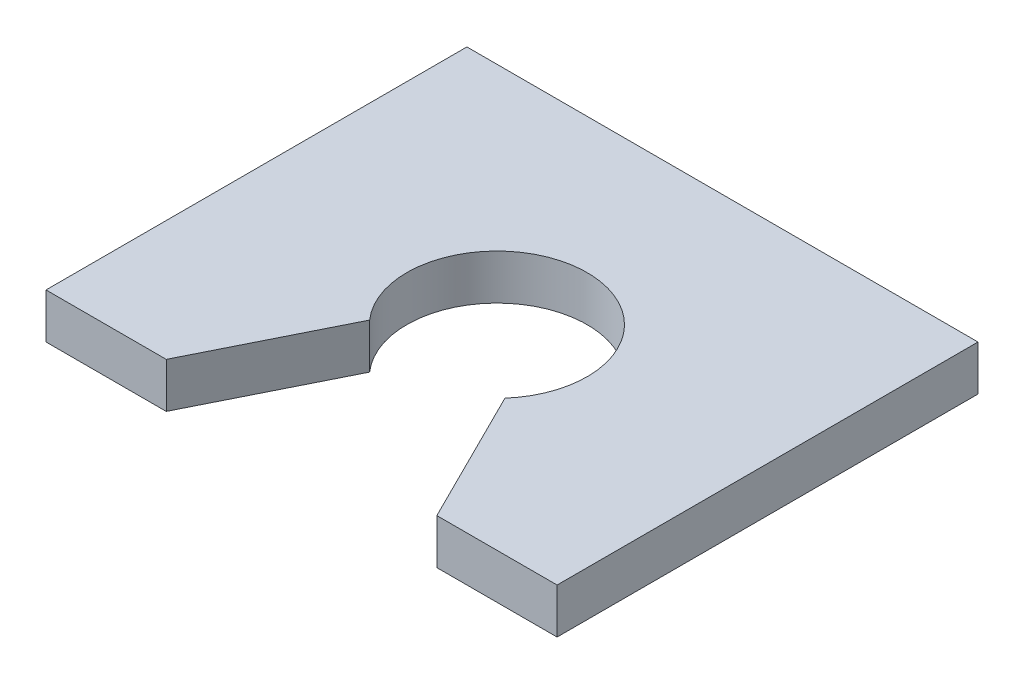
ISO-10303-21;
HEADER;
FILE_DESCRIPTION(('STEP AP214'),'2;1');
FILE_NAME('part.step','',(''),(''),'','','');
FILE_SCHEMA(('AUTOMOTIVE_DESIGN { 1 0 10303 214 1 1 1 1 }'));
ENDSEC;
DATA;
#1=APPLICATION_CONTEXT('core data for automotive mechanical design processes');
#2=APPLICATION_PROTOCOL_DEFINITION('international standard','automotive_design',2000,#1);
#3=PRODUCT_CONTEXT('',#1,'mechanical');
#4=PRODUCT('Part','Part','',(#3));
#5=PRODUCT_RELATED_PRODUCT_CATEGORY('part','',(#4));
#6=PRODUCT_DEFINITION_FORMATION('','',#4);
#7=PRODUCT_DEFINITION_CONTEXT('part definition',#1,'design');
#8=PRODUCT_DEFINITION('design','',#6,#7);
#9=PRODUCT_DEFINITION_SHAPE('','',#8);
#10=(LENGTH_UNIT() NAMED_UNIT(*) SI_UNIT(.MILLI.,.METRE.));
#11=(NAMED_UNIT(*) PLANE_ANGLE_UNIT() SI_UNIT($,.RADIAN.));
#12=(NAMED_UNIT(*) SI_UNIT($,.STERADIAN.) SOLID_ANGLE_UNIT());
#13=UNCERTAINTY_MEASURE_WITH_UNIT(LENGTH_MEASURE(1.E-05),#10,'distance_accuracy_value','');
#14=(GEOMETRIC_REPRESENTATION_CONTEXT(3) GLOBAL_UNCERTAINTY_ASSIGNED_CONTEXT((#13)) GLOBAL_UNIT_ASSIGNED_CONTEXT((#10,
#11,#12)) REPRESENTATION_CONTEXT('',''));
#15=CARTESIAN_POINT('',(0.,0.,0.));
#16=DIRECTION('',(0.,0.,1.));
#17=DIRECTION('',(1.,0.,0.));
#18=AXIS2_PLACEMENT_3D('',#15,#16,#17);
#19=CARTESIAN_POINT('',(0.,3.,0.));
#20=DIRECTION('',(1.,0.,0.));
#21=DIRECTION('',(0.,0.,-1.));
#22=AXIS2_PLACEMENT_3D('',#19,#20,#21);
#23=PLANE('',#22);
#24=DIRECTION('',(0.,0.,1.));
#25=VECTOR('',#24,1.);
#26=CARTESIAN_POINT('',(0.,0.,0.));
#27=LINE('',#26,#25);
#28=CARTESIAN_POINT('',(0.,0.,-28.));
#29=VERTEX_POINT('',#28);
#30=CARTESIAN_POINT('',(0.,0.,0.));
#31=VERTEX_POINT('',#30);
#32=EDGE_CURVE('E98',#29,#31,#27,.T.);
#33=ORIENTED_EDGE('',*,*,#32,.T.);
#34=DIRECTION('',(0.,-1.,0.));
#35=VECTOR('',#34,1.);
#36=CARTESIAN_POINT('',(0.,3.,0.));
#37=LINE('',#36,#35);
#38=CARTESIAN_POINT('',(0.,3.,0.));
#39=VERTEX_POINT('',#38);
#40=EDGE_CURVE('E11',#39,#31,#37,.T.);
#41=ORIENTED_EDGE('',*,*,#40,.F.);
#42=DIRECTION('',(0.,0.,1.));
#43=VECTOR('',#42,1.);
#44=CARTESIAN_POINT('',(0.,3.,0.));
#45=LINE('',#44,#43);
#46=CARTESIAN_POINT('',(0.,3.,-28.));
#47=VERTEX_POINT('',#46);
#48=EDGE_CURVE('E125',#47,#39,#45,.T.);
#49=ORIENTED_EDGE('',*,*,#48,.F.);
#50=DIRECTION('',(0.,-1.,0.));
#51=VECTOR('',#50,1.);
#52=CARTESIAN_POINT('',(0.,3.,-28.));
#53=LINE('',#52,#51);
#54=EDGE_CURVE('E111',#47,#29,#53,.T.);
#55=ORIENTED_EDGE('',*,*,#54,.T.);
#56=EDGE_LOOP('',(#33,#41,#49,#55));
#57=FACE_BOUND('',#56,.T.);
#58=ADVANCED_FACE('F30',(#57),#23,.F.);
#59=CARTESIAN_POINT('',(0.,3.,0.));
#60=DIRECTION('',(0.,0.,-1.));
#61=DIRECTION('',(-1.,0.,0.));
#62=AXIS2_PLACEMENT_3D('',#59,#60,#61);
#63=PLANE('',#62);
#64=DIRECTION('',(1.,0.,0.));
#65=VECTOR('',#64,1.);
#66=CARTESIAN_POINT('',(0.,0.,0.));
#67=LINE('',#66,#65);
#68=CARTESIAN_POINT('',(8.,0.,0.));
#69=VERTEX_POINT('',#68);
#70=EDGE_CURVE('E94',#31,#69,#67,.T.);
#71=ORIENTED_EDGE('',*,*,#70,.T.);
#72=DIRECTION('',(0.,-1.,0.));
#73=VECTOR('',#72,1.);
#74=CARTESIAN_POINT('',(8.,3.,0.));
#75=LINE('',#74,#73);
#76=CARTESIAN_POINT('',(8.,3.,0.));
#77=VERTEX_POINT('',#76);
#78=EDGE_CURVE('E37',#77,#69,#75,.T.);
#79=ORIENTED_EDGE('',*,*,#78,.F.);
#80=DIRECTION('',(1.,0.,0.));
#81=VECTOR('',#80,1.);
#82=CARTESIAN_POINT('',(0.,3.,0.));
#83=LINE('',#82,#81);
#84=EDGE_CURVE('E107',#39,#77,#83,.T.);
#85=ORIENTED_EDGE('',*,*,#84,.F.);
#86=ORIENTED_EDGE('',*,*,#40,.T.);
#87=EDGE_LOOP('',(#71,#79,#85,#86));
#88=FACE_BOUND('',#87,.T.);
#89=ADVANCED_FACE('F106',(#88),#63,.F.);
#90=CARTESIAN_POINT('',(12.5000000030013,3.,-9.03137303));
#91=DIRECTION('',(-0.895048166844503,0.,-0.445969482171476));
#92=DIRECTION('',(-0.445969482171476,0.,0.895048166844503));
#93=AXIS2_PLACEMENT_3D('',#90,#91,#92);
#94=PLANE('',#93);
#95=DIRECTION('',(0.445969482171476,0.,-0.895048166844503));
#96=VECTOR('',#95,1.);
#97=CARTESIAN_POINT('',(12.5000000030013,0.,-9.03137303));
#98=LINE('',#97,#96);
#99=CARTESIAN_POINT('',(12.5000000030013,0.,-9.03137303));
#100=VERTEX_POINT('',#99);
#101=EDGE_CURVE('E100',#69,#100,#98,.T.);
#102=ORIENTED_EDGE('',*,*,#101,.T.);
#103=DIRECTION('',(0.,-1.,0.));
#104=VECTOR('',#103,1.);
#105=CARTESIAN_POINT('',(12.5000000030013,3.,-9.03137303));
#106=LINE('',#105,#104);
#107=CARTESIAN_POINT('',(12.5000000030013,3.,-9.03137303));
#108=VERTEX_POINT('',#107);
#109=EDGE_CURVE('E151',#108,#100,#106,.T.);
#110=ORIENTED_EDGE('',*,*,#109,.F.);
#111=DIRECTION('',(0.445969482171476,0.,-0.895048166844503));
#112=VECTOR('',#111,1.);
#113=CARTESIAN_POINT('',(12.5000000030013,3.,-9.03137303));
#114=LINE('',#113,#112);
#115=EDGE_CURVE('E128',#77,#108,#114,.T.);
#116=ORIENTED_EDGE('',*,*,#115,.F.);
#117=ORIENTED_EDGE('',*,*,#78,.T.);
#118=EDGE_LOOP('',(#102,#110,#116,#117));
#119=FACE_BOUND('',#118,.T.);
#120=ADVANCED_FACE('F155',(#119),#94,.F.);
#121=CARTESIAN_POINT('',(17.,3.,-13.));
#122=DIRECTION('',(0.,-1.,0.));
#123=DIRECTION('',(0.,0.,-1.));
#124=AXIS2_PLACEMENT_3D('',#121,#122,#123);
#125=CYLINDRICAL_SURFACE('',#124,6.);
#126=CARTESIAN_POINT('',(17.,0.,-13.));
#127=DIRECTION('',(0.,-1.,0.));
#128=DIRECTION('',(0.,0.,1.));
#129=AXIS2_PLACEMENT_3D('',#126,#127,#128);
#130=CIRCLE('',#129,6.);
#131=CARTESIAN_POINT('',(21.4999999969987,0.,-9.03137303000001));
#132=VERTEX_POINT('',#131);
#133=EDGE_CURVE('E115',#100,#132,#130,.T.);
#134=ORIENTED_EDGE('',*,*,#133,.T.);
#135=DIRECTION('',(0.,-1.,0.));
#136=VECTOR('',#135,1.);
#137=CARTESIAN_POINT('',(21.4999999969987,3.,-9.03137303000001));
#138=LINE('',#137,#136);
#139=CARTESIAN_POINT('',(21.4999999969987,3.,-9.03137303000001));
#140=VERTEX_POINT('',#139);
#141=EDGE_CURVE('E148',#140,#132,#138,.T.);
#142=ORIENTED_EDGE('',*,*,#141,.F.);
#143=CARTESIAN_POINT('',(17.,3.,-13.));
#144=DIRECTION('',(0.,-1.,0.));
#145=DIRECTION('',(0.,0.,1.));
#146=AXIS2_PLACEMENT_3D('',#143,#144,#145);
#147=CIRCLE('',#146,6.);
#148=EDGE_CURVE('E130',#108,#140,#147,.T.);
#149=ORIENTED_EDGE('',*,*,#148,.F.);
#150=ORIENTED_EDGE('',*,*,#109,.T.);
#151=EDGE_LOOP('',(#134,#142,#149,#150));
#152=FACE_BOUND('',#151,.T.);
#153=ADVANCED_FACE('F163',(#152),#125,.F.);
#154=CARTESIAN_POINT('',(21.4999999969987,3.,-9.03137303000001));
#155=DIRECTION('',(0.895048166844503,0.,-0.445969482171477));
#156=DIRECTION('',(-0.445969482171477,0.,-0.895048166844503));
#157=AXIS2_PLACEMENT_3D('',#154,#155,#156);
#158=PLANE('',#157);
#159=DIRECTION('',(0.445969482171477,0.,0.895048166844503));
#160=VECTOR('',#159,1.);
#161=CARTESIAN_POINT('',(21.4999999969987,0.,-9.03137303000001));
#162=LINE('',#161,#160);
#163=CARTESIAN_POINT('',(26.,0.,0.));
#164=VERTEX_POINT('',#163);
#165=EDGE_CURVE('E117',#132,#164,#162,.T.);
#166=ORIENTED_EDGE('',*,*,#165,.T.);
#167=DIRECTION('',(0.,-1.,0.));
#168=VECTOR('',#167,1.);
#169=CARTESIAN_POINT('',(26.,3.,0.));
#170=LINE('',#169,#168);
#171=CARTESIAN_POINT('',(26.,3.,0.));
#172=VERTEX_POINT('',#171);
#173=EDGE_CURVE('E145',#172,#164,#170,.T.);
#174=ORIENTED_EDGE('',*,*,#173,.F.);
#175=DIRECTION('',(0.445969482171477,0.,0.895048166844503));
#176=VECTOR('',#175,1.);
#177=CARTESIAN_POINT('',(21.4999999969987,3.,-9.03137303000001));
#178=LINE('',#177,#176);
#179=EDGE_CURVE('E132',#140,#172,#178,.T.);
#180=ORIENTED_EDGE('',*,*,#179,.F.);
#181=ORIENTED_EDGE('',*,*,#141,.T.);
#182=EDGE_LOOP('',(#166,#174,#180,#181));
#183=FACE_BOUND('',#182,.T.);
#184=ADVANCED_FACE('F166',(#183),#158,.F.);
#185=CARTESIAN_POINT('',(26.,3.,0.));
#186=DIRECTION('',(0.,0.,-1.));
#187=DIRECTION('',(-1.,0.,0.));
#188=AXIS2_PLACEMENT_3D('',#185,#186,#187);
#189=PLANE('',#188);
#190=DIRECTION('',(1.,0.,0.));
#191=VECTOR('',#190,1.);
#192=CARTESIAN_POINT('',(26.,0.,0.));
#193=LINE('',#192,#191);
#194=CARTESIAN_POINT('',(34.,0.,0.));
#195=VERTEX_POINT('',#194);
#196=EDGE_CURVE('E119',#164,#195,#193,.T.);
#197=ORIENTED_EDGE('',*,*,#196,.T.);
#198=DIRECTION('',(0.,-1.,0.));
#199=VECTOR('',#198,1.);
#200=CARTESIAN_POINT('',(34.,3.,0.));
#201=LINE('',#200,#199);
#202=CARTESIAN_POINT('',(34.,3.,0.));
#203=VERTEX_POINT('',#202);
#204=EDGE_CURVE('E142',#203,#195,#201,.T.);
#205=ORIENTED_EDGE('',*,*,#204,.F.);
#206=DIRECTION('',(1.,0.,0.));
#207=VECTOR('',#206,1.);
#208=CARTESIAN_POINT('',(26.,3.,0.));
#209=LINE('',#208,#207);
#210=EDGE_CURVE('E134',#172,#203,#209,.T.);
#211=ORIENTED_EDGE('',*,*,#210,.F.);
#212=ORIENTED_EDGE('',*,*,#173,.T.);
#213=EDGE_LOOP('',(#197,#205,#211,#212));
#214=FACE_BOUND('',#213,.T.);
#215=ADVANCED_FACE('F171',(#214),#189,.F.);
#216=CARTESIAN_POINT('',(34.,3.,0.));
#217=DIRECTION('',(-1.,0.,0.));
#218=DIRECTION('',(0.,0.,1.));
#219=AXIS2_PLACEMENT_3D('',#216,#217,#218);
#220=PLANE('',#219);
#221=DIRECTION('',(0.,0.,-1.));
#222=VECTOR('',#221,1.);
#223=CARTESIAN_POINT('',(34.,0.,0.));
#224=LINE('',#223,#222);
#225=CARTESIAN_POINT('',(34.,0.,-28.));
#226=VERTEX_POINT('',#225);
#227=EDGE_CURVE('E121',#195,#226,#224,.T.);
#228=ORIENTED_EDGE('',*,*,#227,.T.);
#229=DIRECTION('',(0.,-1.,0.));
#230=VECTOR('',#229,1.);
#231=CARTESIAN_POINT('',(34.,3.,-28.));
#232=LINE('',#231,#230);
#233=CARTESIAN_POINT('',(34.,3.,-28.));
#234=VERTEX_POINT('',#233);
#235=EDGE_CURVE('E139',#234,#226,#232,.T.);
#236=ORIENTED_EDGE('',*,*,#235,.F.);
#237=DIRECTION('',(0.,0.,-1.));
#238=VECTOR('',#237,1.);
#239=CARTESIAN_POINT('',(34.,3.,0.));
#240=LINE('',#239,#238);
#241=EDGE_CURVE('E49',#203,#234,#240,.T.);
#242=ORIENTED_EDGE('',*,*,#241,.F.);
#243=ORIENTED_EDGE('',*,*,#204,.T.);
#244=EDGE_LOOP('',(#228,#236,#242,#243));
#245=FACE_BOUND('',#244,.T.);
#246=ADVANCED_FACE('F174',(#245),#220,.F.);
#247=CARTESIAN_POINT('',(0.,3.,-28.));
#248=DIRECTION('',(0.,0.,1.));
#249=DIRECTION('',(1.,0.,0.));
#250=AXIS2_PLACEMENT_3D('',#247,#248,#249);
#251=PLANE('',#250);
#252=DIRECTION('',(-1.,0.,0.));
#253=VECTOR('',#252,1.);
#254=CARTESIAN_POINT('',(0.,0.,-28.));
#255=LINE('',#254,#253);
#256=EDGE_CURVE('E123',#226,#29,#255,.T.);
#257=ORIENTED_EDGE('',*,*,#256,.T.);
#258=ORIENTED_EDGE('',*,*,#54,.F.);
#259=DIRECTION('',(-1.,0.,0.));
#260=VECTOR('',#259,1.);
#261=CARTESIAN_POINT('',(0.,3.,-28.));
#262=LINE('',#261,#260);
#263=EDGE_CURVE('E44',#234,#47,#262,.T.);
#264=ORIENTED_EDGE('',*,*,#263,.F.);
#265=ORIENTED_EDGE('',*,*,#235,.T.);
#266=EDGE_LOOP('',(#257,#258,#264,#265));
#267=FACE_BOUND('',#266,.T.);
#268=ADVANCED_FACE('F176',(#267),#251,.F.);
#269=CARTESIAN_POINT('',(17.,3.,-13.));
#270=DIRECTION('',(0.,1.,0.));
#271=DIRECTION('',(0.,0.,1.));
#272=AXIS2_PLACEMENT_3D('',#269,#270,#271);
#273=PLANE('',#272);
#274=ORIENTED_EDGE('',*,*,#48,.T.);
#275=ORIENTED_EDGE('',*,*,#84,.T.);
#276=ORIENTED_EDGE('',*,*,#115,.T.);
#277=ORIENTED_EDGE('',*,*,#148,.T.);
#278=ORIENTED_EDGE('',*,*,#179,.T.);
#279=ORIENTED_EDGE('',*,*,#210,.T.);
#280=ORIENTED_EDGE('',*,*,#241,.T.);
#281=ORIENTED_EDGE('',*,*,#263,.T.);
#282=EDGE_LOOP('',(#274,#275,#276,#277,#278,#279,#280,#281));
#283=FACE_BOUND('',#282,.T.);
#284=ADVANCED_FACE('F158',(#283),#273,.T.);
#285=CARTESIAN_POINT('',(17.,0.,-13.));
#286=DIRECTION('',(0.,1.,0.));
#287=DIRECTION('',(0.,0.,1.));
#288=AXIS2_PLACEMENT_3D('',#285,#286,#287);
#289=PLANE('',#288);
#290=ORIENTED_EDGE('',*,*,#32,.F.);
#291=ORIENTED_EDGE('',*,*,#256,.F.);
#292=ORIENTED_EDGE('',*,*,#227,.F.);
#293=ORIENTED_EDGE('',*,*,#196,.F.);
#294=ORIENTED_EDGE('',*,*,#165,.F.);
#295=ORIENTED_EDGE('',*,*,#133,.F.);
#296=ORIENTED_EDGE('',*,*,#101,.F.);
#297=ORIENTED_EDGE('',*,*,#70,.F.);
#298=EDGE_LOOP('',(#290,#291,#292,#293,#294,#295,#296,#297));
#299=FACE_BOUND('',#298,.T.);
#300=ADVANCED_FACE('F95',(#299),#289,.F.);
#301=CLOSED_SHELL('',(#58,#89,#120,#153,#184,#215,#246,#268,#284,#300));
#302=MANIFOLD_SOLID_BREP('B2',#301);
#303=ADVANCED_BREP_SHAPE_REPRESENTATION('',(#18,#302),#14);
#304=SHAPE_DEFINITION_REPRESENTATION(#9,#303);
ENDSEC;
END-ISO-10303-21;
